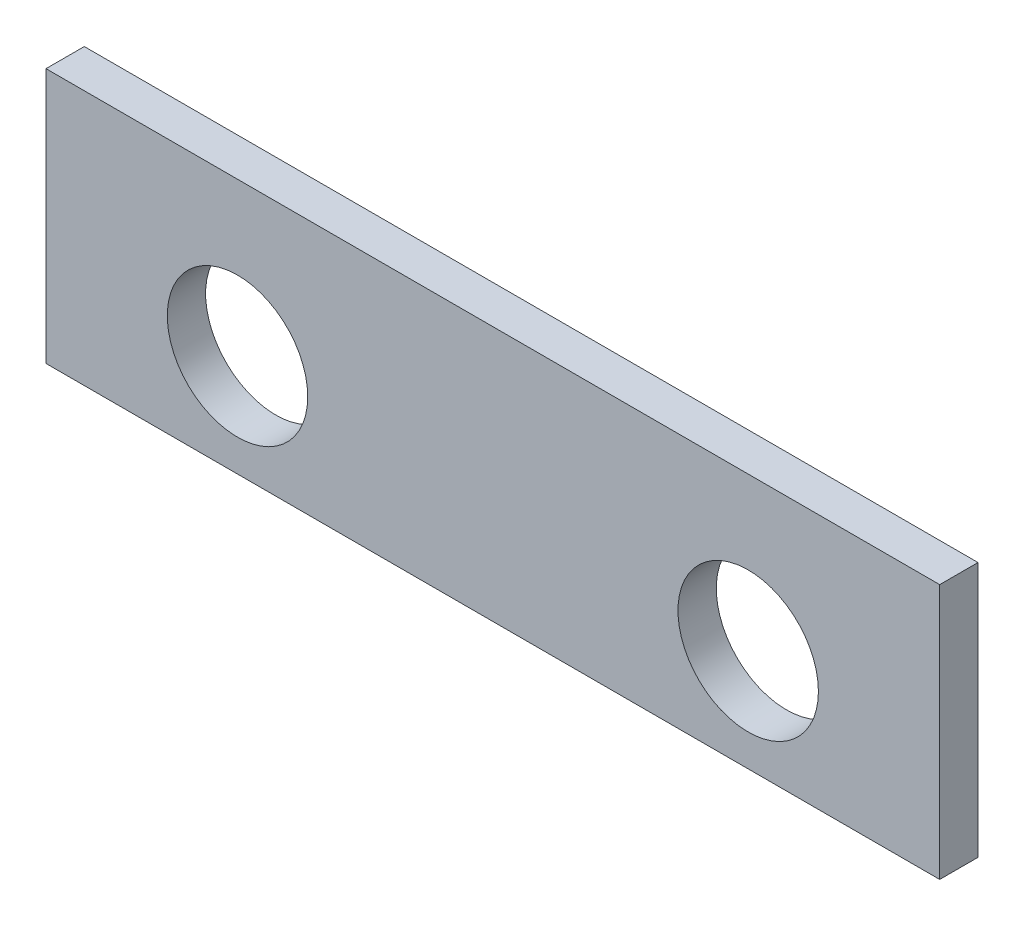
ISO-10303-21;
HEADER;
FILE_DESCRIPTION(('STEP AP214'),'2;1');
FILE_NAME('part.step','',(''),(''),'','','');
FILE_SCHEMA(('AUTOMOTIVE_DESIGN { 1 0 10303 214 1 1 1 1 }'));
ENDSEC;
DATA;
#1=APPLICATION_CONTEXT('core data for automotive mechanical design processes');
#2=APPLICATION_PROTOCOL_DEFINITION('international standard','automotive_design',2000,#1);
#3=PRODUCT_CONTEXT('',#1,'mechanical');
#4=PRODUCT('Part','Part','',(#3));
#5=PRODUCT_RELATED_PRODUCT_CATEGORY('part','',(#4));
#6=PRODUCT_DEFINITION_FORMATION('','',#4);
#7=PRODUCT_DEFINITION_CONTEXT('part definition',#1,'design');
#8=PRODUCT_DEFINITION('design','',#6,#7);
#9=PRODUCT_DEFINITION_SHAPE('','',#8);
#10=(LENGTH_UNIT() NAMED_UNIT(*) SI_UNIT(.MILLI.,.METRE.));
#11=(NAMED_UNIT(*) PLANE_ANGLE_UNIT() SI_UNIT($,.RADIAN.));
#12=(NAMED_UNIT(*) SI_UNIT($,.STERADIAN.) SOLID_ANGLE_UNIT());
#13=UNCERTAINTY_MEASURE_WITH_UNIT(LENGTH_MEASURE(1.E-05),#10,'distance_accuracy_value','');
#14=(GEOMETRIC_REPRESENTATION_CONTEXT(3) GLOBAL_UNCERTAINTY_ASSIGNED_CONTEXT((#13)) GLOBAL_UNIT_ASSIGNED_CONTEXT((#10,
#11,#12)) REPRESENTATION_CONTEXT('',''));
#15=CARTESIAN_POINT('',(0.,0.,0.));
#16=DIRECTION('',(0.,0.,1.));
#17=DIRECTION('',(1.,0.,0.));
#18=AXIS2_PLACEMENT_3D('',#15,#16,#17);
#19=CARTESIAN_POINT('',(0.,20.,3.));
#20=DIRECTION('',(0.,0.,-1.));
#21=DIRECTION('',(-1.,0.,0.));
#22=AXIS2_PLACEMENT_3D('',#19,#20,#21);
#23=PLANE('',#22);
#24=CARTESIAN_POINT('',(15.,8.,3.));
#25=DIRECTION('',(0.,0.,1.));
#26=DIRECTION('',(1.,0.,0.));
#27=AXIS2_PLACEMENT_3D('',#24,#25,#26);
#28=CIRCLE('',#27,5.5);
#29=CARTESIAN_POINT('',(20.5,8.,3.));
#30=VERTEX_POINT('',#29);
#31=EDGE_CURVE('E93',#30,#30,#28,.T.);
#32=ORIENTED_EDGE('',*,*,#31,.F.);
#33=EDGE_LOOP('',(#32));
#34=FACE_BOUND('',#33,.T.);
#35=DIRECTION('',(0.,-1.,0.));
#36=VECTOR('',#35,1.);
#37=CARTESIAN_POINT('',(0.,0.,3.));
#38=LINE('',#37,#36);
#39=CARTESIAN_POINT('',(0.,20.,3.));
#40=VERTEX_POINT('',#39);
#41=CARTESIAN_POINT('',(0.,0.,3.));
#42=VERTEX_POINT('',#41);
#43=EDGE_CURVE('E103',#40,#42,#38,.T.);
#44=ORIENTED_EDGE('',*,*,#43,.T.);
#45=DIRECTION('',(1.,0.,0.));
#46=VECTOR('',#45,1.);
#47=CARTESIAN_POINT('',(0.,0.,3.));
#48=LINE('',#47,#46);
#49=CARTESIAN_POINT('',(70.,0.,3.));
#50=VERTEX_POINT('',#49);
#51=EDGE_CURVE('E88',#42,#50,#48,.T.);
#52=ORIENTED_EDGE('',*,*,#51,.T.);
#53=DIRECTION('',(0.,1.,0.));
#54=VECTOR('',#53,1.);
#55=CARTESIAN_POINT('',(70.,0.,3.));
#56=LINE('',#55,#54);
#57=CARTESIAN_POINT('',(70.,20.,3.));
#58=VERTEX_POINT('',#57);
#59=EDGE_CURVE('E54',#50,#58,#56,.T.);
#60=ORIENTED_EDGE('',*,*,#59,.T.);
#61=DIRECTION('',(-1.,0.,0.));
#62=VECTOR('',#61,1.);
#63=CARTESIAN_POINT('',(0.,20.,3.));
#64=LINE('',#63,#62);
#65=EDGE_CURVE('E49',#58,#40,#64,.T.);
#66=ORIENTED_EDGE('',*,*,#65,.T.);
#67=EDGE_LOOP('',(#44,#52,#60,#66));
#68=FACE_BOUND('',#67,.T.);
#69=CARTESIAN_POINT('',(55.,8.,3.));
#70=DIRECTION('',(0.,0.,1.));
#71=DIRECTION('',(1.,0.,0.));
#72=AXIS2_PLACEMENT_3D('',#69,#70,#71);
#73=CIRCLE('',#72,5.5);
#74=CARTESIAN_POINT('',(60.5,8.,3.));
#75=VERTEX_POINT('',#74);
#76=EDGE_CURVE('E121',#75,#75,#73,.T.);
#77=ORIENTED_EDGE('',*,*,#76,.F.);
#78=EDGE_LOOP('',(#77));
#79=FACE_BOUND('',#78,.T.);
#80=ADVANCED_FACE('F34',(#34,#68,#79),#23,.F.);
#81=CARTESIAN_POINT('',(0.,20.,0.));
#82=DIRECTION('',(0.,0.,-1.));
#83=DIRECTION('',(-1.,0.,0.));
#84=AXIS2_PLACEMENT_3D('',#81,#82,#83);
#85=PLANE('',#84);
#86=CARTESIAN_POINT('',(15.,8.,0.));
#87=DIRECTION('',(0.,0.,1.));
#88=DIRECTION('',(1.,0.,0.));
#89=AXIS2_PLACEMENT_3D('',#86,#87,#88);
#90=CIRCLE('',#89,5.5);
#91=CARTESIAN_POINT('',(20.5,8.,0.));
#92=VERTEX_POINT('',#91);
#93=EDGE_CURVE('E96',#92,#92,#90,.T.);
#94=ORIENTED_EDGE('',*,*,#93,.T.);
#95=EDGE_LOOP('',(#94));
#96=FACE_BOUND('',#95,.T.);
#97=DIRECTION('',(0.,-1.,0.));
#98=VECTOR('',#97,1.);
#99=CARTESIAN_POINT('',(0.,0.,0.));
#100=LINE('',#99,#98);
#101=CARTESIAN_POINT('',(0.,20.,0.));
#102=VERTEX_POINT('',#101);
#103=CARTESIAN_POINT('',(0.,0.,0.));
#104=VERTEX_POINT('',#103);
#105=EDGE_CURVE('E80',#102,#104,#100,.T.);
#106=ORIENTED_EDGE('',*,*,#105,.F.);
#107=DIRECTION('',(-1.,0.,0.));
#108=VECTOR('',#107,1.);
#109=CARTESIAN_POINT('',(0.,20.,0.));
#110=LINE('',#109,#108);
#111=CARTESIAN_POINT('',(70.,20.,0.));
#112=VERTEX_POINT('',#111);
#113=EDGE_CURVE('E101',#112,#102,#110,.T.);
#114=ORIENTED_EDGE('',*,*,#113,.F.);
#115=DIRECTION('',(0.,1.,0.));
#116=VECTOR('',#115,1.);
#117=CARTESIAN_POINT('',(70.,0.,0.));
#118=LINE('',#117,#116);
#119=CARTESIAN_POINT('',(70.,0.,0.));
#120=VERTEX_POINT('',#119);
#121=EDGE_CURVE('E81',#120,#112,#118,.T.);
#122=ORIENTED_EDGE('',*,*,#121,.F.);
#123=DIRECTION('',(1.,0.,0.));
#124=VECTOR('',#123,1.);
#125=CARTESIAN_POINT('',(0.,0.,0.));
#126=LINE('',#125,#124);
#127=EDGE_CURVE('E75',#104,#120,#126,.T.);
#128=ORIENTED_EDGE('',*,*,#127,.F.);
#129=EDGE_LOOP('',(#106,#114,#122,#128));
#130=FACE_BOUND('',#129,.T.);
#131=CARTESIAN_POINT('',(55.,8.,0.));
#132=DIRECTION('',(0.,0.,1.));
#133=DIRECTION('',(1.,0.,0.));
#134=AXIS2_PLACEMENT_3D('',#131,#132,#133);
#135=CIRCLE('',#134,5.5);
#136=CARTESIAN_POINT('',(60.5,8.,0.));
#137=VERTEX_POINT('',#136);
#138=EDGE_CURVE('E123',#137,#137,#135,.T.);
#139=ORIENTED_EDGE('',*,*,#138,.T.);
#140=EDGE_LOOP('',(#139));
#141=FACE_BOUND('',#140,.T.);
#142=ADVANCED_FACE('F76',(#96,#130,#141),#85,.T.);
#143=CARTESIAN_POINT('',(0.,0.,3.));
#144=DIRECTION('',(1.,0.,0.));
#145=DIRECTION('',(0.,0.,-1.));
#146=AXIS2_PLACEMENT_3D('',#143,#144,#145);
#147=PLANE('',#146);
#148=ORIENTED_EDGE('',*,*,#105,.T.);
#149=DIRECTION('',(0.,0.,-1.));
#150=VECTOR('',#149,1.);
#151=CARTESIAN_POINT('',(0.,0.,3.));
#152=LINE('',#151,#150);
#153=EDGE_CURVE('E11',#42,#104,#152,.T.);
#154=ORIENTED_EDGE('',*,*,#153,.F.);
#155=ORIENTED_EDGE('',*,*,#43,.F.);
#156=DIRECTION('',(0.,0.,-1.));
#157=VECTOR('',#156,1.);
#158=CARTESIAN_POINT('',(0.,20.,3.));
#159=LINE('',#158,#157);
#160=EDGE_CURVE('E92',#40,#102,#159,.T.);
#161=ORIENTED_EDGE('',*,*,#160,.T.);
#162=EDGE_LOOP('',(#148,#154,#155,#161));
#163=FACE_BOUND('',#162,.T.);
#164=ADVANCED_FACE('F36',(#163),#147,.F.);
#165=CARTESIAN_POINT('',(0.,0.,3.));
#166=DIRECTION('',(0.,1.,0.));
#167=DIRECTION('',(0.,0.,1.));
#168=AXIS2_PLACEMENT_3D('',#165,#166,#167);
#169=PLANE('',#168);
#170=ORIENTED_EDGE('',*,*,#127,.T.);
#171=DIRECTION('',(0.,0.,-1.));
#172=VECTOR('',#171,1.);
#173=CARTESIAN_POINT('',(70.,0.,3.));
#174=LINE('',#173,#172);
#175=EDGE_CURVE('E42',#50,#120,#174,.T.);
#176=ORIENTED_EDGE('',*,*,#175,.F.);
#177=ORIENTED_EDGE('',*,*,#51,.F.);
#178=ORIENTED_EDGE('',*,*,#153,.T.);
#179=EDGE_LOOP('',(#170,#176,#177,#178));
#180=FACE_BOUND('',#179,.T.);
#181=ADVANCED_FACE('F87',(#180),#169,.F.);
#182=CARTESIAN_POINT('',(70.,0.,3.));
#183=DIRECTION('',(-1.,0.,0.));
#184=DIRECTION('',(0.,0.,1.));
#185=AXIS2_PLACEMENT_3D('',#182,#183,#184);
#186=PLANE('',#185);
#187=ORIENTED_EDGE('',*,*,#121,.T.);
#188=DIRECTION('',(0.,0.,-1.));
#189=VECTOR('',#188,1.);
#190=CARTESIAN_POINT('',(70.,20.,3.));
#191=LINE('',#190,#189);
#192=EDGE_CURVE('E109',#58,#112,#191,.T.);
#193=ORIENTED_EDGE('',*,*,#192,.F.);
#194=ORIENTED_EDGE('',*,*,#59,.F.);
#195=ORIENTED_EDGE('',*,*,#175,.T.);
#196=EDGE_LOOP('',(#187,#193,#194,#195));
#197=FACE_BOUND('',#196,.T.);
#198=ADVANCED_FACE('F112',(#197),#186,.F.);
#199=CARTESIAN_POINT('',(0.,20.,3.));
#200=DIRECTION('',(0.,-1.,0.));
#201=DIRECTION('',(0.,0.,-1.));
#202=AXIS2_PLACEMENT_3D('',#199,#200,#201);
#203=PLANE('',#202);
#204=ORIENTED_EDGE('',*,*,#113,.T.);
#205=ORIENTED_EDGE('',*,*,#160,.F.);
#206=ORIENTED_EDGE('',*,*,#65,.F.);
#207=ORIENTED_EDGE('',*,*,#192,.T.);
#208=EDGE_LOOP('',(#204,#205,#206,#207));
#209=FACE_BOUND('',#208,.T.);
#210=ADVANCED_FACE('F114',(#209),#203,.F.);
#211=CARTESIAN_POINT('',(15.,8.,3.));
#212=DIRECTION('',(0.,0.,-1.));
#213=DIRECTION('',(-1.,0.,0.));
#214=AXIS2_PLACEMENT_3D('',#211,#212,#213);
#215=CYLINDRICAL_SURFACE('',#214,5.5);
#216=ORIENTED_EDGE('',*,*,#31,.T.);
#217=EDGE_LOOP('',(#216));
#218=FACE_BOUND('',#217,.T.);
#219=ORIENTED_EDGE('',*,*,#93,.F.);
#220=EDGE_LOOP('',(#219));
#221=FACE_BOUND('',#220,.T.);
#222=ADVANCED_FACE('F132',(#218,#221),#215,.F.);
#223=CARTESIAN_POINT('',(55.,8.,3.));
#224=DIRECTION('',(0.,0.,-1.));
#225=DIRECTION('',(-1.,0.,0.));
#226=AXIS2_PLACEMENT_3D('',#223,#224,#225);
#227=CYLINDRICAL_SURFACE('',#226,5.5);
#228=ORIENTED_EDGE('',*,*,#76,.T.);
#229=EDGE_LOOP('',(#228));
#230=FACE_BOUND('',#229,.T.);
#231=ORIENTED_EDGE('',*,*,#138,.F.);
#232=EDGE_LOOP('',(#231));
#233=FACE_BOUND('',#232,.T.);
#234=ADVANCED_FACE('F130',(#230,#233),#227,.F.);
#235=CLOSED_SHELL('',(#80,#142,#164,#181,#198,#210,#222,#234));
#236=MANIFOLD_SOLID_BREP('B2',#235);
#237=ADVANCED_BREP_SHAPE_REPRESENTATION('',(#18,#236),#14);
#238=SHAPE_DEFINITION_REPRESENTATION(#9,#237);
ENDSEC;
END-ISO-10303-21;
